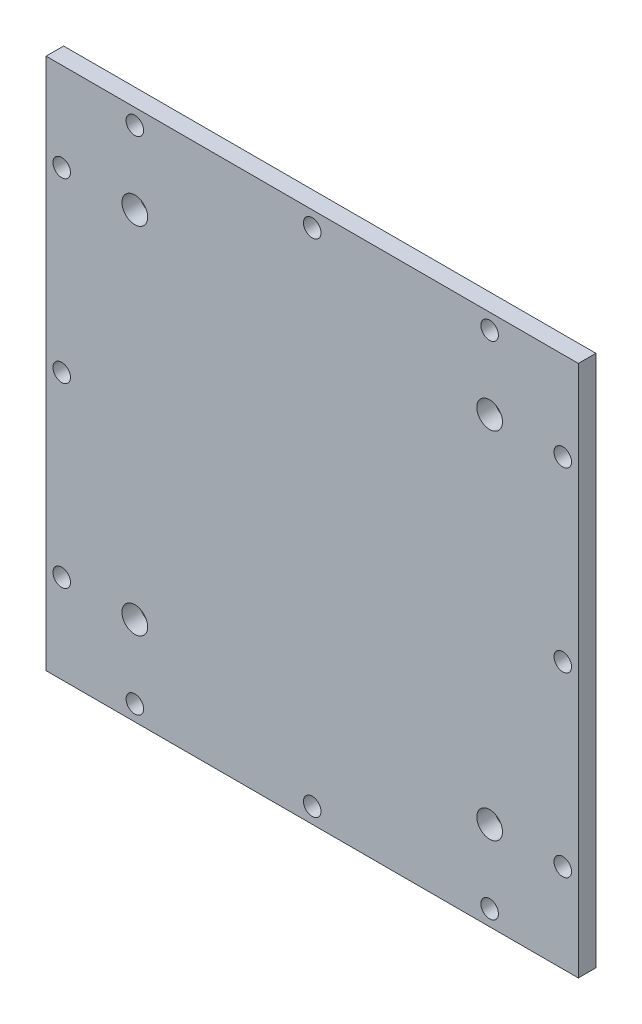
ISO-10303-21;
HEADER;
FILE_DESCRIPTION(('STEP AP214'),'2;1');
FILE_NAME('part.step','',(''),(''),'','','');
FILE_SCHEMA(('AUTOMOTIVE_DESIGN { 1 0 10303 214 1 1 1 1 }'));
ENDSEC;
DATA;
#1=APPLICATION_CONTEXT('core data for automotive mechanical design processes');
#2=APPLICATION_PROTOCOL_DEFINITION('international standard','automotive_design',2000,#1);
#3=PRODUCT_CONTEXT('',#1,'mechanical');
#4=PRODUCT('Part','Part','',(#3));
#5=PRODUCT_RELATED_PRODUCT_CATEGORY('part','',(#4));
#6=PRODUCT_DEFINITION_FORMATION('','',#4);
#7=PRODUCT_DEFINITION_CONTEXT('part definition',#1,'design');
#8=PRODUCT_DEFINITION('design','',#6,#7);
#9=PRODUCT_DEFINITION_SHAPE('','',#8);
#10=(LENGTH_UNIT() NAMED_UNIT(*) SI_UNIT(.MILLI.,.METRE.));
#11=(NAMED_UNIT(*) PLANE_ANGLE_UNIT() SI_UNIT($,.RADIAN.));
#12=(NAMED_UNIT(*) SI_UNIT($,.STERADIAN.) SOLID_ANGLE_UNIT());
#13=UNCERTAINTY_MEASURE_WITH_UNIT(LENGTH_MEASURE(1.E-05),#10,'distance_accuracy_value','');
#14=(GEOMETRIC_REPRESENTATION_CONTEXT(3) GLOBAL_UNCERTAINTY_ASSIGNED_CONTEXT((#13)) GLOBAL_UNIT_ASSIGNED_CONTEXT((#10,
#11,#12)) REPRESENTATION_CONTEXT('',''));
#15=CARTESIAN_POINT('',(0.,0.,0.));
#16=DIRECTION('',(0.,0.,1.));
#17=DIRECTION('',(1.,0.,0.));
#18=AXIS2_PLACEMENT_3D('',#15,#16,#17);
#19=CARTESIAN_POINT('',(-68.25,68.25,4.5));
#20=DIRECTION('',(1.,0.,0.));
#21=DIRECTION('',(0.,0.,-1.));
#22=AXIS2_PLACEMENT_3D('',#19,#20,#21);
#23=PLANE('',#22);
#24=DIRECTION('',(0.,-1.,0.));
#25=VECTOR('',#24,1.);
#26=CARTESIAN_POINT('',(-68.25,68.25,0.));
#27=LINE('',#26,#25);
#28=CARTESIAN_POINT('',(-68.25,68.25,0.));
#29=VERTEX_POINT('',#28);
#30=CARTESIAN_POINT('',(-68.25,-68.25,0.));
#31=VERTEX_POINT('',#30);
#32=EDGE_CURVE('E96',#29,#31,#27,.T.);
#33=ORIENTED_EDGE('',*,*,#32,.T.);
#34=DIRECTION('',(0.,0.,-1.));
#35=VECTOR('',#34,1.);
#36=CARTESIAN_POINT('',(-68.25,-68.25,4.5));
#37=LINE('',#36,#35);
#38=CARTESIAN_POINT('',(-68.25,-68.25,4.5));
#39=VERTEX_POINT('',#38);
#40=EDGE_CURVE('E11',#39,#31,#37,.T.);
#41=ORIENTED_EDGE('',*,*,#40,.F.);
#42=DIRECTION('',(0.,-1.,0.));
#43=VECTOR('',#42,1.);
#44=CARTESIAN_POINT('',(-68.25,68.25,4.5));
#45=LINE('',#44,#43);
#46=CARTESIAN_POINT('',(-68.25,68.25,4.5));
#47=VERTEX_POINT('',#46);
#48=EDGE_CURVE('E84',#47,#39,#45,.T.);
#49=ORIENTED_EDGE('',*,*,#48,.F.);
#50=DIRECTION('',(0.,0.,-1.));
#51=VECTOR('',#50,1.);
#52=CARTESIAN_POINT('',(-68.25,68.25,4.5));
#53=LINE('',#52,#51);
#54=EDGE_CURVE('E92',#47,#29,#53,.T.);
#55=ORIENTED_EDGE('',*,*,#54,.T.);
#56=EDGE_LOOP('',(#33,#41,#49,#55));
#57=FACE_BOUND('',#56,.T.);
#58=ADVANCED_FACE('F33',(#57),#23,.F.);
#59=CARTESIAN_POINT('',(-68.25,-68.25,4.5));
#60=DIRECTION('',(0.,1.,0.));
#61=DIRECTION('',(0.,0.,1.));
#62=AXIS2_PLACEMENT_3D('',#59,#60,#61);
#63=PLANE('',#62);
#64=DIRECTION('',(1.,0.,0.));
#65=VECTOR('',#64,1.);
#66=CARTESIAN_POINT('',(-68.25,-68.25,0.));
#67=LINE('',#66,#65);
#68=CARTESIAN_POINT('',(68.25,-68.25,0.));
#69=VERTEX_POINT('',#68);
#70=EDGE_CURVE('E88',#31,#69,#67,.T.);
#71=ORIENTED_EDGE('',*,*,#70,.T.);
#72=DIRECTION('',(0.,0.,-1.));
#73=VECTOR('',#72,1.);
#74=CARTESIAN_POINT('',(68.25,-68.25,4.5));
#75=LINE('',#74,#73);
#76=CARTESIAN_POINT('',(68.25,-68.25,4.5));
#77=VERTEX_POINT('',#76);
#78=EDGE_CURVE('E41',#77,#69,#75,.T.);
#79=ORIENTED_EDGE('',*,*,#78,.F.);
#80=DIRECTION('',(1.,0.,0.));
#81=VECTOR('',#80,1.);
#82=CARTESIAN_POINT('',(-68.25,-68.25,4.5));
#83=LINE('',#82,#81);
#84=EDGE_CURVE('E79',#39,#77,#83,.T.);
#85=ORIENTED_EDGE('',*,*,#84,.F.);
#86=ORIENTED_EDGE('',*,*,#40,.T.);
#87=EDGE_LOOP('',(#71,#79,#85,#86));
#88=FACE_BOUND('',#87,.T.);
#89=ADVANCED_FACE('F87',(#88),#63,.F.);
#90=CARTESIAN_POINT('',(68.25,68.25,4.5));
#91=DIRECTION('',(-1.,0.,0.));
#92=DIRECTION('',(0.,0.,1.));
#93=AXIS2_PLACEMENT_3D('',#90,#91,#92);
#94=PLANE('',#93);
#95=DIRECTION('',(0.,1.,0.));
#96=VECTOR('',#95,1.);
#97=CARTESIAN_POINT('',(68.25,68.25,0.));
#98=LINE('',#97,#96);
#99=CARTESIAN_POINT('',(68.25,68.25,0.));
#100=VERTEX_POINT('',#99);
#101=EDGE_CURVE('E66',#69,#100,#98,.T.);
#102=ORIENTED_EDGE('',*,*,#101,.T.);
#103=DIRECTION('',(0.,0.,-1.));
#104=VECTOR('',#103,1.);
#105=CARTESIAN_POINT('',(68.25,68.25,4.5));
#106=LINE('',#105,#104);
#107=CARTESIAN_POINT('',(68.25,68.25,4.5));
#108=VERTEX_POINT('',#107);
#109=EDGE_CURVE('E89',#108,#100,#106,.T.);
#110=ORIENTED_EDGE('',*,*,#109,.F.);
#111=DIRECTION('',(0.,1.,0.));
#112=VECTOR('',#111,1.);
#113=CARTESIAN_POINT('',(68.25,68.25,4.5));
#114=LINE('',#113,#112);
#115=EDGE_CURVE('E82',#77,#108,#114,.T.);
#116=ORIENTED_EDGE('',*,*,#115,.F.);
#117=ORIENTED_EDGE('',*,*,#78,.T.);
#118=EDGE_LOOP('',(#102,#110,#116,#117));
#119=FACE_BOUND('',#118,.T.);
#120=ADVANCED_FACE('F90',(#119),#94,.F.);
#121=CARTESIAN_POINT('',(-68.25,68.25,4.5));
#122=DIRECTION('',(0.,-1.,0.));
#123=DIRECTION('',(0.,0.,-1.));
#124=AXIS2_PLACEMENT_3D('',#121,#122,#123);
#125=PLANE('',#124);
#126=DIRECTION('',(-1.,0.,0.));
#127=VECTOR('',#126,1.);
#128=CARTESIAN_POINT('',(-68.25,68.25,0.));
#129=LINE('',#128,#127);
#130=EDGE_CURVE('E72',#100,#29,#129,.T.);
#131=ORIENTED_EDGE('',*,*,#130,.T.);
#132=ORIENTED_EDGE('',*,*,#54,.F.);
#133=DIRECTION('',(-1.,0.,0.));
#134=VECTOR('',#133,1.);
#135=CARTESIAN_POINT('',(-68.25,68.25,4.5));
#136=LINE('',#135,#134);
#137=EDGE_CURVE('E49',#108,#47,#136,.T.);
#138=ORIENTED_EDGE('',*,*,#137,.F.);
#139=ORIENTED_EDGE('',*,*,#109,.T.);
#140=EDGE_LOOP('',(#131,#132,#138,#139));
#141=FACE_BOUND('',#140,.T.);
#142=ADVANCED_FACE('F104',(#141),#125,.F.);
#143=CARTESIAN_POINT('',(0.,0.,4.5));
#144=DIRECTION('',(0.,0.,1.));
#145=DIRECTION('',(1.,0.,0.));
#146=AXIS2_PLACEMENT_3D('',#143,#144,#145);
#147=PLANE('',#146);
#148=CARTESIAN_POINT('',(-45.5,45.5,4.5));
#149=DIRECTION('',(0.,0.,1.));
#150=DIRECTION('',(1.,0.,0.));
#151=AXIS2_PLACEMENT_3D('',#148,#149,#150);
#152=CIRCLE('',#151,3.3);
#153=CARTESIAN_POINT('',(-42.2,45.5,4.5));
#154=VERTEX_POINT('',#153);
#155=EDGE_CURVE('E202',#154,#154,#152,.T.);
#156=ORIENTED_EDGE('',*,*,#155,.F.);
#157=EDGE_LOOP('',(#156));
#158=FACE_BOUND('',#157,.T.);
#159=CARTESIAN_POINT('',(-45.5,-45.5,4.5));
#160=DIRECTION('',(0.,0.,1.));
#161=DIRECTION('',(1.,0.,0.));
#162=AXIS2_PLACEMENT_3D('',#159,#160,#161);
#163=CIRCLE('',#162,3.3);
#164=CARTESIAN_POINT('',(-42.2,-45.5,4.5));
#165=VERTEX_POINT('',#164);
#166=EDGE_CURVE('E196',#165,#165,#163,.T.);
#167=ORIENTED_EDGE('',*,*,#166,.F.);
#168=EDGE_LOOP('',(#167));
#169=FACE_BOUND('',#168,.T.);
#170=CARTESIAN_POINT('',(45.5,-45.5,4.5));
#171=DIRECTION('',(0.,0.,1.));
#172=DIRECTION('',(1.,0.,0.));
#173=AXIS2_PLACEMENT_3D('',#170,#171,#172);
#174=CIRCLE('',#173,3.3);
#175=CARTESIAN_POINT('',(48.8,-45.5,4.5));
#176=VERTEX_POINT('',#175);
#177=EDGE_CURVE('E190',#176,#176,#174,.T.);
#178=ORIENTED_EDGE('',*,*,#177,.F.);
#179=EDGE_LOOP('',(#178));
#180=FACE_BOUND('',#179,.T.);
#181=CARTESIAN_POINT('',(45.5,45.5,4.5));
#182=DIRECTION('',(0.,0.,1.));
#183=DIRECTION('',(1.,0.,0.));
#184=AXIS2_PLACEMENT_3D('',#181,#182,#183);
#185=CIRCLE('',#184,3.3);
#186=CARTESIAN_POINT('',(48.8,45.5,4.5));
#187=VERTEX_POINT('',#186);
#188=EDGE_CURVE('E184',#187,#187,#185,.T.);
#189=ORIENTED_EDGE('',*,*,#188,.F.);
#190=EDGE_LOOP('',(#189));
#191=FACE_BOUND('',#190,.T.);
#192=CARTESIAN_POINT('',(-64.25,45.5,4.5));
#193=DIRECTION('',(0.,0.,1.));
#194=DIRECTION('',(1.,0.,0.));
#195=AXIS2_PLACEMENT_3D('',#192,#193,#194);
#196=CIRCLE('',#195,2.25);
#197=CARTESIAN_POINT('',(-62.,45.5,4.5));
#198=VERTEX_POINT('',#197);
#199=EDGE_CURVE('E178',#198,#198,#196,.T.);
#200=ORIENTED_EDGE('',*,*,#199,.F.);
#201=EDGE_LOOP('',(#200));
#202=FACE_BOUND('',#201,.T.);
#203=CARTESIAN_POINT('',(-64.25,0.,4.5));
#204=DIRECTION('',(0.,0.,1.));
#205=DIRECTION('',(1.,0.,0.));
#206=AXIS2_PLACEMENT_3D('',#203,#204,#205);
#207=CIRCLE('',#206,2.25);
#208=CARTESIAN_POINT('',(-62.,0.,4.5));
#209=VERTEX_POINT('',#208);
#210=EDGE_CURVE('E172',#209,#209,#207,.T.);
#211=ORIENTED_EDGE('',*,*,#210,.F.);
#212=EDGE_LOOP('',(#211));
#213=FACE_BOUND('',#212,.T.);
#214=CARTESIAN_POINT('',(-64.25,-45.5,4.5));
#215=DIRECTION('',(0.,0.,1.));
#216=DIRECTION('',(1.,0.,0.));
#217=AXIS2_PLACEMENT_3D('',#214,#215,#216);
#218=CIRCLE('',#217,2.25);
#219=CARTESIAN_POINT('',(-62.,-45.5,4.5));
#220=VERTEX_POINT('',#219);
#221=EDGE_CURVE('E166',#220,#220,#218,.T.);
#222=ORIENTED_EDGE('',*,*,#221,.F.);
#223=EDGE_LOOP('',(#222));
#224=FACE_BOUND('',#223,.T.);
#225=CARTESIAN_POINT('',(-45.5,64.25,4.5));
#226=DIRECTION('',(0.,0.,1.));
#227=DIRECTION('',(1.,0.,0.));
#228=AXIS2_PLACEMENT_3D('',#225,#226,#227);
#229=CIRCLE('',#228,2.25);
#230=CARTESIAN_POINT('',(-43.25,64.25,4.5));
#231=VERTEX_POINT('',#230);
#232=EDGE_CURVE('E160',#231,#231,#229,.T.);
#233=ORIENTED_EDGE('',*,*,#232,.F.);
#234=EDGE_LOOP('',(#233));
#235=FACE_BOUND('',#234,.T.);
#236=CARTESIAN_POINT('',(0.,64.25,4.5));
#237=DIRECTION('',(0.,0.,1.));
#238=DIRECTION('',(1.,0.,0.));
#239=AXIS2_PLACEMENT_3D('',#236,#237,#238);
#240=CIRCLE('',#239,2.25);
#241=CARTESIAN_POINT('',(2.25,64.25,4.5));
#242=VERTEX_POINT('',#241);
#243=EDGE_CURVE('E154',#242,#242,#240,.T.);
#244=ORIENTED_EDGE('',*,*,#243,.F.);
#245=EDGE_LOOP('',(#244));
#246=FACE_BOUND('',#245,.T.);
#247=CARTESIAN_POINT('',(45.5,64.25,4.5));
#248=DIRECTION('',(0.,0.,1.));
#249=DIRECTION('',(1.,0.,0.));
#250=AXIS2_PLACEMENT_3D('',#247,#248,#249);
#251=CIRCLE('',#250,2.25);
#252=CARTESIAN_POINT('',(47.75,64.25,4.5));
#253=VERTEX_POINT('',#252);
#254=EDGE_CURVE('E148',#253,#253,#251,.T.);
#255=ORIENTED_EDGE('',*,*,#254,.F.);
#256=EDGE_LOOP('',(#255));
#257=FACE_BOUND('',#256,.T.);
#258=CARTESIAN_POINT('',(64.25,-45.5,4.5));
#259=DIRECTION('',(0.,0.,1.));
#260=DIRECTION('',(1.,0.,0.));
#261=AXIS2_PLACEMENT_3D('',#258,#259,#260);
#262=CIRCLE('',#261,2.25);
#263=CARTESIAN_POINT('',(66.5,-45.5,4.5));
#264=VERTEX_POINT('',#263);
#265=EDGE_CURVE('E142',#264,#264,#262,.T.);
#266=ORIENTED_EDGE('',*,*,#265,.F.);
#267=EDGE_LOOP('',(#266));
#268=FACE_BOUND('',#267,.T.);
#269=CARTESIAN_POINT('',(64.25,0.,4.5));
#270=DIRECTION('',(0.,0.,1.));
#271=DIRECTION('',(1.,0.,0.));
#272=AXIS2_PLACEMENT_3D('',#269,#270,#271);
#273=CIRCLE('',#272,2.25);
#274=CARTESIAN_POINT('',(66.5,0.,4.5));
#275=VERTEX_POINT('',#274);
#276=EDGE_CURVE('E136',#275,#275,#273,.T.);
#277=ORIENTED_EDGE('',*,*,#276,.F.);
#278=EDGE_LOOP('',(#277));
#279=FACE_BOUND('',#278,.T.);
#280=CARTESIAN_POINT('',(64.25,45.5,4.5));
#281=DIRECTION('',(0.,0.,1.));
#282=DIRECTION('',(1.,0.,0.));
#283=AXIS2_PLACEMENT_3D('',#280,#281,#282);
#284=CIRCLE('',#283,2.25);
#285=CARTESIAN_POINT('',(66.5,45.5,4.5));
#286=VERTEX_POINT('',#285);
#287=EDGE_CURVE('E130',#286,#286,#284,.T.);
#288=ORIENTED_EDGE('',*,*,#287,.F.);
#289=EDGE_LOOP('',(#288));
#290=FACE_BOUND('',#289,.T.);
#291=CARTESIAN_POINT('',(45.5,-64.25,4.5));
#292=DIRECTION('',(0.,0.,1.));
#293=DIRECTION('',(1.,0.,0.));
#294=AXIS2_PLACEMENT_3D('',#291,#292,#293);
#295=CIRCLE('',#294,2.25);
#296=CARTESIAN_POINT('',(47.75,-64.25,4.5));
#297=VERTEX_POINT('',#296);
#298=EDGE_CURVE('E124',#297,#297,#295,.T.);
#299=ORIENTED_EDGE('',*,*,#298,.F.);
#300=EDGE_LOOP('',(#299));
#301=FACE_BOUND('',#300,.T.);
#302=CARTESIAN_POINT('',(0.,-64.25,4.5));
#303=DIRECTION('',(0.,0.,1.));
#304=DIRECTION('',(1.,0.,0.));
#305=AXIS2_PLACEMENT_3D('',#302,#303,#304);
#306=CIRCLE('',#305,2.25);
#307=CARTESIAN_POINT('',(2.25,-64.25,4.5));
#308=VERTEX_POINT('',#307);
#309=EDGE_CURVE('E118',#308,#308,#306,.T.);
#310=ORIENTED_EDGE('',*,*,#309,.F.);
#311=EDGE_LOOP('',(#310));
#312=FACE_BOUND('',#311,.T.);
#313=CARTESIAN_POINT('',(-45.5,-64.25,4.5));
#314=DIRECTION('',(0.,0.,1.));
#315=DIRECTION('',(1.,0.,0.));
#316=AXIS2_PLACEMENT_3D('',#313,#314,#315);
#317=CIRCLE('',#316,2.25);
#318=CARTESIAN_POINT('',(-43.25,-64.25,4.5));
#319=VERTEX_POINT('',#318);
#320=EDGE_CURVE('E112',#319,#319,#317,.T.);
#321=ORIENTED_EDGE('',*,*,#320,.F.);
#322=EDGE_LOOP('',(#321));
#323=FACE_BOUND('',#322,.T.);
#324=ORIENTED_EDGE('',*,*,#48,.T.);
#325=ORIENTED_EDGE('',*,*,#84,.T.);
#326=ORIENTED_EDGE('',*,*,#115,.T.);
#327=ORIENTED_EDGE('',*,*,#137,.T.);
#328=EDGE_LOOP('',(#324,#325,#326,#327));
#329=FACE_BOUND('',#328,.T.);
#330=ADVANCED_FACE('F80',(#158,#169,#180,#191,#202,#213,#224,#235,#246,#257,#268,#279,#290,#301,
#312,#323,#329),#147,.T.);
#331=CARTESIAN_POINT('',(0.,0.,0.));
#332=DIRECTION('',(0.,0.,1.));
#333=DIRECTION('',(1.,0.,0.));
#334=AXIS2_PLACEMENT_3D('',#331,#332,#333);
#335=PLANE('',#334);
#336=CARTESIAN_POINT('',(-45.5,45.5,0.));
#337=DIRECTION('',(0.,0.,1.));
#338=DIRECTION('',(1.,0.,0.));
#339=AXIS2_PLACEMENT_3D('',#336,#337,#338);
#340=CIRCLE('',#339,3.3);
#341=CARTESIAN_POINT('',(-42.2,45.5,0.));
#342=VERTEX_POINT('',#341);
#343=EDGE_CURVE('E199',#342,#342,#340,.T.);
#344=ORIENTED_EDGE('',*,*,#343,.T.);
#345=EDGE_LOOP('',(#344));
#346=FACE_BOUND('',#345,.T.);
#347=CARTESIAN_POINT('',(-45.5,-45.5,0.));
#348=DIRECTION('',(0.,0.,1.));
#349=DIRECTION('',(1.,0.,0.));
#350=AXIS2_PLACEMENT_3D('',#347,#348,#349);
#351=CIRCLE('',#350,3.3);
#352=CARTESIAN_POINT('',(-42.2,-45.5,0.));
#353=VERTEX_POINT('',#352);
#354=EDGE_CURVE('E193',#353,#353,#351,.T.);
#355=ORIENTED_EDGE('',*,*,#354,.T.);
#356=EDGE_LOOP('',(#355));
#357=FACE_BOUND('',#356,.T.);
#358=CARTESIAN_POINT('',(45.5,-45.5,0.));
#359=DIRECTION('',(0.,0.,1.));
#360=DIRECTION('',(1.,0.,0.));
#361=AXIS2_PLACEMENT_3D('',#358,#359,#360);
#362=CIRCLE('',#361,3.3);
#363=CARTESIAN_POINT('',(48.8,-45.5,0.));
#364=VERTEX_POINT('',#363);
#365=EDGE_CURVE('E187',#364,#364,#362,.T.);
#366=ORIENTED_EDGE('',*,*,#365,.T.);
#367=EDGE_LOOP('',(#366));
#368=FACE_BOUND('',#367,.T.);
#369=CARTESIAN_POINT('',(45.5,45.5,0.));
#370=DIRECTION('',(0.,0.,1.));
#371=DIRECTION('',(1.,0.,0.));
#372=AXIS2_PLACEMENT_3D('',#369,#370,#371);
#373=CIRCLE('',#372,3.3);
#374=CARTESIAN_POINT('',(48.8,45.5,0.));
#375=VERTEX_POINT('',#374);
#376=EDGE_CURVE('E181',#375,#375,#373,.T.);
#377=ORIENTED_EDGE('',*,*,#376,.T.);
#378=EDGE_LOOP('',(#377));
#379=FACE_BOUND('',#378,.T.);
#380=CARTESIAN_POINT('',(-64.25,45.5,0.));
#381=DIRECTION('',(0.,0.,1.));
#382=DIRECTION('',(1.,0.,0.));
#383=AXIS2_PLACEMENT_3D('',#380,#381,#382);
#384=CIRCLE('',#383,2.25);
#385=CARTESIAN_POINT('',(-62.,45.5,0.));
#386=VERTEX_POINT('',#385);
#387=EDGE_CURVE('E175',#386,#386,#384,.T.);
#388=ORIENTED_EDGE('',*,*,#387,.T.);
#389=EDGE_LOOP('',(#388));
#390=FACE_BOUND('',#389,.T.);
#391=CARTESIAN_POINT('',(-64.25,0.,0.));
#392=DIRECTION('',(0.,0.,1.));
#393=DIRECTION('',(1.,0.,0.));
#394=AXIS2_PLACEMENT_3D('',#391,#392,#393);
#395=CIRCLE('',#394,2.25);
#396=CARTESIAN_POINT('',(-62.,0.,0.));
#397=VERTEX_POINT('',#396);
#398=EDGE_CURVE('E169',#397,#397,#395,.T.);
#399=ORIENTED_EDGE('',*,*,#398,.T.);
#400=EDGE_LOOP('',(#399));
#401=FACE_BOUND('',#400,.T.);
#402=CARTESIAN_POINT('',(-64.25,-45.5,0.));
#403=DIRECTION('',(0.,0.,1.));
#404=DIRECTION('',(1.,0.,0.));
#405=AXIS2_PLACEMENT_3D('',#402,#403,#404);
#406=CIRCLE('',#405,2.25);
#407=CARTESIAN_POINT('',(-62.,-45.5,0.));
#408=VERTEX_POINT('',#407);
#409=EDGE_CURVE('E163',#408,#408,#406,.T.);
#410=ORIENTED_EDGE('',*,*,#409,.T.);
#411=EDGE_LOOP('',(#410));
#412=FACE_BOUND('',#411,.T.);
#413=CARTESIAN_POINT('',(-45.5,64.25,0.));
#414=DIRECTION('',(0.,0.,1.));
#415=DIRECTION('',(1.,0.,0.));
#416=AXIS2_PLACEMENT_3D('',#413,#414,#415);
#417=CIRCLE('',#416,2.25);
#418=CARTESIAN_POINT('',(-43.25,64.25,0.));
#419=VERTEX_POINT('',#418);
#420=EDGE_CURVE('E157',#419,#419,#417,.T.);
#421=ORIENTED_EDGE('',*,*,#420,.T.);
#422=EDGE_LOOP('',(#421));
#423=FACE_BOUND('',#422,.T.);
#424=CARTESIAN_POINT('',(0.,64.25,0.));
#425=DIRECTION('',(0.,0.,1.));
#426=DIRECTION('',(1.,0.,0.));
#427=AXIS2_PLACEMENT_3D('',#424,#425,#426);
#428=CIRCLE('',#427,2.25);
#429=CARTESIAN_POINT('',(2.25,64.25,0.));
#430=VERTEX_POINT('',#429);
#431=EDGE_CURVE('E151',#430,#430,#428,.T.);
#432=ORIENTED_EDGE('',*,*,#431,.T.);
#433=EDGE_LOOP('',(#432));
#434=FACE_BOUND('',#433,.T.);
#435=CARTESIAN_POINT('',(45.5,64.25,0.));
#436=DIRECTION('',(0.,0.,1.));
#437=DIRECTION('',(1.,0.,0.));
#438=AXIS2_PLACEMENT_3D('',#435,#436,#437);
#439=CIRCLE('',#438,2.25);
#440=CARTESIAN_POINT('',(47.75,64.25,0.));
#441=VERTEX_POINT('',#440);
#442=EDGE_CURVE('E145',#441,#441,#439,.T.);
#443=ORIENTED_EDGE('',*,*,#442,.T.);
#444=EDGE_LOOP('',(#443));
#445=FACE_BOUND('',#444,.T.);
#446=CARTESIAN_POINT('',(64.25,-45.5,0.));
#447=DIRECTION('',(0.,0.,1.));
#448=DIRECTION('',(1.,0.,0.));
#449=AXIS2_PLACEMENT_3D('',#446,#447,#448);
#450=CIRCLE('',#449,2.25);
#451=CARTESIAN_POINT('',(66.5,-45.5,0.));
#452=VERTEX_POINT('',#451);
#453=EDGE_CURVE('E139',#452,#452,#450,.T.);
#454=ORIENTED_EDGE('',*,*,#453,.T.);
#455=EDGE_LOOP('',(#454));
#456=FACE_BOUND('',#455,.T.);
#457=CARTESIAN_POINT('',(64.25,0.,0.));
#458=DIRECTION('',(0.,0.,1.));
#459=DIRECTION('',(1.,0.,0.));
#460=AXIS2_PLACEMENT_3D('',#457,#458,#459);
#461=CIRCLE('',#460,2.25);
#462=CARTESIAN_POINT('',(66.5,0.,0.));
#463=VERTEX_POINT('',#462);
#464=EDGE_CURVE('E133',#463,#463,#461,.T.);
#465=ORIENTED_EDGE('',*,*,#464,.T.);
#466=EDGE_LOOP('',(#465));
#467=FACE_BOUND('',#466,.T.);
#468=CARTESIAN_POINT('',(64.25,45.5,0.));
#469=DIRECTION('',(0.,0.,1.));
#470=DIRECTION('',(1.,0.,0.));
#471=AXIS2_PLACEMENT_3D('',#468,#469,#470);
#472=CIRCLE('',#471,2.25);
#473=CARTESIAN_POINT('',(66.5,45.5,0.));
#474=VERTEX_POINT('',#473);
#475=EDGE_CURVE('E127',#474,#474,#472,.T.);
#476=ORIENTED_EDGE('',*,*,#475,.T.);
#477=EDGE_LOOP('',(#476));
#478=FACE_BOUND('',#477,.T.);
#479=CARTESIAN_POINT('',(45.5,-64.25,0.));
#480=DIRECTION('',(0.,0.,1.));
#481=DIRECTION('',(1.,0.,0.));
#482=AXIS2_PLACEMENT_3D('',#479,#480,#481);
#483=CIRCLE('',#482,2.25);
#484=CARTESIAN_POINT('',(47.75,-64.25,0.));
#485=VERTEX_POINT('',#484);
#486=EDGE_CURVE('E121',#485,#485,#483,.T.);
#487=ORIENTED_EDGE('',*,*,#486,.T.);
#488=EDGE_LOOP('',(#487));
#489=FACE_BOUND('',#488,.T.);
#490=CARTESIAN_POINT('',(0.,-64.25,0.));
#491=DIRECTION('',(0.,0.,1.));
#492=DIRECTION('',(1.,0.,0.));
#493=AXIS2_PLACEMENT_3D('',#490,#491,#492);
#494=CIRCLE('',#493,2.25);
#495=CARTESIAN_POINT('',(2.25,-64.25,0.));
#496=VERTEX_POINT('',#495);
#497=EDGE_CURVE('E115',#496,#496,#494,.T.);
#498=ORIENTED_EDGE('',*,*,#497,.T.);
#499=EDGE_LOOP('',(#498));
#500=FACE_BOUND('',#499,.T.);
#501=CARTESIAN_POINT('',(-45.5,-64.25,0.));
#502=DIRECTION('',(0.,0.,1.));
#503=DIRECTION('',(1.,0.,0.));
#504=AXIS2_PLACEMENT_3D('',#501,#502,#503);
#505=CIRCLE('',#504,2.25);
#506=CARTESIAN_POINT('',(-43.25,-64.25,0.));
#507=VERTEX_POINT('',#506);
#508=EDGE_CURVE('E99',#507,#507,#505,.T.);
#509=ORIENTED_EDGE('',*,*,#508,.T.);
#510=EDGE_LOOP('',(#509));
#511=FACE_BOUND('',#510,.T.);
#512=ORIENTED_EDGE('',*,*,#32,.F.);
#513=ORIENTED_EDGE('',*,*,#130,.F.);
#514=ORIENTED_EDGE('',*,*,#101,.F.);
#515=ORIENTED_EDGE('',*,*,#70,.F.);
#516=EDGE_LOOP('',(#512,#513,#514,#515));
#517=FACE_BOUND('',#516,.T.);
#518=ADVANCED_FACE('F107',(#346,#357,#368,#379,#390,#401,#412,#423,#434,#445,#456,#467,#478,
#489,#500,#511,#517),#335,.F.);
#519=CARTESIAN_POINT('',(-45.5,-64.25,4.5));
#520=DIRECTION('',(0.,0.,1.));
#521=DIRECTION('',(1.,0.,0.));
#522=AXIS2_PLACEMENT_3D('',#519,#520,#521);
#523=CYLINDRICAL_SURFACE('',#522,2.25);
#524=ORIENTED_EDGE('',*,*,#508,.F.);
#525=EDGE_LOOP('',(#524));
#526=FACE_BOUND('',#525,.T.);
#527=ORIENTED_EDGE('',*,*,#320,.T.);
#528=EDGE_LOOP('',(#527));
#529=FACE_BOUND('',#528,.T.);
#530=ADVANCED_FACE('F241',(#526,#529),#523,.F.);
#531=CARTESIAN_POINT('',(0.,-64.25,4.5));
#532=DIRECTION('',(0.,0.,1.));
#533=DIRECTION('',(1.,0.,0.));
#534=AXIS2_PLACEMENT_3D('',#531,#532,#533);
#535=CYLINDRICAL_SURFACE('',#534,2.25);
#536=ORIENTED_EDGE('',*,*,#497,.F.);
#537=EDGE_LOOP('',(#536));
#538=FACE_BOUND('',#537,.T.);
#539=ORIENTED_EDGE('',*,*,#309,.T.);
#540=EDGE_LOOP('',(#539));
#541=FACE_BOUND('',#540,.T.);
#542=ADVANCED_FACE('F243',(#538,#541),#535,.F.);
#543=CARTESIAN_POINT('',(45.5,-64.25,4.5));
#544=DIRECTION('',(0.,0.,1.));
#545=DIRECTION('',(1.,0.,0.));
#546=AXIS2_PLACEMENT_3D('',#543,#544,#545);
#547=CYLINDRICAL_SURFACE('',#546,2.25);
#548=ORIENTED_EDGE('',*,*,#486,.F.);
#549=EDGE_LOOP('',(#548));
#550=FACE_BOUND('',#549,.T.);
#551=ORIENTED_EDGE('',*,*,#298,.T.);
#552=EDGE_LOOP('',(#551));
#553=FACE_BOUND('',#552,.T.);
#554=ADVANCED_FACE('F250',(#550,#553),#547,.F.);
#555=CARTESIAN_POINT('',(64.25,45.5,4.5));
#556=DIRECTION('',(0.,0.,1.));
#557=DIRECTION('',(1.,0.,0.));
#558=AXIS2_PLACEMENT_3D('',#555,#556,#557);
#559=CYLINDRICAL_SURFACE('',#558,2.25);
#560=ORIENTED_EDGE('',*,*,#475,.F.);
#561=EDGE_LOOP('',(#560));
#562=FACE_BOUND('',#561,.T.);
#563=ORIENTED_EDGE('',*,*,#287,.T.);
#564=EDGE_LOOP('',(#563));
#565=FACE_BOUND('',#564,.T.);
#566=ADVANCED_FACE('F357',(#562,#565),#559,.F.);
#567=CARTESIAN_POINT('',(64.25,0.,4.5));
#568=DIRECTION('',(0.,0.,1.));
#569=DIRECTION('',(1.,0.,0.));
#570=AXIS2_PLACEMENT_3D('',#567,#568,#569);
#571=CYLINDRICAL_SURFACE('',#570,2.25);
#572=ORIENTED_EDGE('',*,*,#464,.F.);
#573=EDGE_LOOP('',(#572));
#574=FACE_BOUND('',#573,.T.);
#575=ORIENTED_EDGE('',*,*,#276,.T.);
#576=EDGE_LOOP('',(#575));
#577=FACE_BOUND('',#576,.T.);
#578=ADVANCED_FACE('F353',(#574,#577),#571,.F.);
#579=CARTESIAN_POINT('',(64.25,-45.5,4.5));
#580=DIRECTION('',(0.,0.,1.));
#581=DIRECTION('',(1.,0.,0.));
#582=AXIS2_PLACEMENT_3D('',#579,#580,#581);
#583=CYLINDRICAL_SURFACE('',#582,2.25);
#584=ORIENTED_EDGE('',*,*,#453,.F.);
#585=EDGE_LOOP('',(#584));
#586=FACE_BOUND('',#585,.T.);
#587=ORIENTED_EDGE('',*,*,#265,.T.);
#588=EDGE_LOOP('',(#587));
#589=FACE_BOUND('',#588,.T.);
#590=ADVANCED_FACE('F349',(#586,#589),#583,.F.);
#591=CARTESIAN_POINT('',(45.5,64.25,4.5));
#592=DIRECTION('',(0.,0.,1.));
#593=DIRECTION('',(1.,0.,0.));
#594=AXIS2_PLACEMENT_3D('',#591,#592,#593);
#595=CYLINDRICAL_SURFACE('',#594,2.25);
#596=ORIENTED_EDGE('',*,*,#442,.F.);
#597=EDGE_LOOP('',(#596));
#598=FACE_BOUND('',#597,.T.);
#599=ORIENTED_EDGE('',*,*,#254,.T.);
#600=EDGE_LOOP('',(#599));
#601=FACE_BOUND('',#600,.T.);
#602=ADVANCED_FACE('F345',(#598,#601),#595,.F.);
#603=CARTESIAN_POINT('',(0.,64.25,4.5));
#604=DIRECTION('',(0.,0.,1.));
#605=DIRECTION('',(1.,0.,0.));
#606=AXIS2_PLACEMENT_3D('',#603,#604,#605);
#607=CYLINDRICAL_SURFACE('',#606,2.25);
#608=ORIENTED_EDGE('',*,*,#431,.F.);
#609=EDGE_LOOP('',(#608));
#610=FACE_BOUND('',#609,.T.);
#611=ORIENTED_EDGE('',*,*,#243,.T.);
#612=EDGE_LOOP('',(#611));
#613=FACE_BOUND('',#612,.T.);
#614=ADVANCED_FACE('F341',(#610,#613),#607,.F.);
#615=CARTESIAN_POINT('',(-45.5,64.25,4.5));
#616=DIRECTION('',(0.,0.,1.));
#617=DIRECTION('',(1.,0.,0.));
#618=AXIS2_PLACEMENT_3D('',#615,#616,#617);
#619=CYLINDRICAL_SURFACE('',#618,2.25);
#620=ORIENTED_EDGE('',*,*,#420,.F.);
#621=EDGE_LOOP('',(#620));
#622=FACE_BOUND('',#621,.T.);
#623=ORIENTED_EDGE('',*,*,#232,.T.);
#624=EDGE_LOOP('',(#623));
#625=FACE_BOUND('',#624,.T.);
#626=ADVANCED_FACE('F337',(#622,#625),#619,.F.);
#627=CARTESIAN_POINT('',(-64.25,-45.5,4.5));
#628=DIRECTION('',(0.,0.,1.));
#629=DIRECTION('',(1.,0.,0.));
#630=AXIS2_PLACEMENT_3D('',#627,#628,#629);
#631=CYLINDRICAL_SURFACE('',#630,2.25);
#632=ORIENTED_EDGE('',*,*,#409,.F.);
#633=EDGE_LOOP('',(#632));
#634=FACE_BOUND('',#633,.T.);
#635=ORIENTED_EDGE('',*,*,#221,.T.);
#636=EDGE_LOOP('',(#635));
#637=FACE_BOUND('',#636,.T.);
#638=ADVANCED_FACE('F333',(#634,#637),#631,.F.);
#639=CARTESIAN_POINT('',(-64.25,0.,4.5));
#640=DIRECTION('',(0.,0.,1.));
#641=DIRECTION('',(1.,0.,0.));
#642=AXIS2_PLACEMENT_3D('',#639,#640,#641);
#643=CYLINDRICAL_SURFACE('',#642,2.25);
#644=ORIENTED_EDGE('',*,*,#398,.F.);
#645=EDGE_LOOP('',(#644));
#646=FACE_BOUND('',#645,.T.);
#647=ORIENTED_EDGE('',*,*,#210,.T.);
#648=EDGE_LOOP('',(#647));
#649=FACE_BOUND('',#648,.T.);
#650=ADVANCED_FACE('F329',(#646,#649),#643,.F.);
#651=CARTESIAN_POINT('',(-64.25,45.5,4.5));
#652=DIRECTION('',(0.,0.,1.));
#653=DIRECTION('',(1.,0.,0.));
#654=AXIS2_PLACEMENT_3D('',#651,#652,#653);
#655=CYLINDRICAL_SURFACE('',#654,2.25);
#656=ORIENTED_EDGE('',*,*,#387,.F.);
#657=EDGE_LOOP('',(#656));
#658=FACE_BOUND('',#657,.T.);
#659=ORIENTED_EDGE('',*,*,#199,.T.);
#660=EDGE_LOOP('',(#659));
#661=FACE_BOUND('',#660,.T.);
#662=ADVANCED_FACE('F291',(#658,#661),#655,.F.);
#663=CARTESIAN_POINT('',(45.5,45.5,4.5));
#664=DIRECTION('',(0.,0.,1.));
#665=DIRECTION('',(1.,0.,0.));
#666=AXIS2_PLACEMENT_3D('',#663,#664,#665);
#667=CYLINDRICAL_SURFACE('',#666,3.3);
#668=ORIENTED_EDGE('',*,*,#376,.F.);
#669=EDGE_LOOP('',(#668));
#670=FACE_BOUND('',#669,.T.);
#671=ORIENTED_EDGE('',*,*,#188,.T.);
#672=EDGE_LOOP('',(#671));
#673=FACE_BOUND('',#672,.T.);
#674=ADVANCED_FACE('F285',(#670,#673),#667,.F.);
#675=CARTESIAN_POINT('',(45.5,-45.5,4.5));
#676=DIRECTION('',(0.,0.,1.));
#677=DIRECTION('',(1.,0.,0.));
#678=AXIS2_PLACEMENT_3D('',#675,#676,#677);
#679=CYLINDRICAL_SURFACE('',#678,3.3);
#680=ORIENTED_EDGE('',*,*,#365,.F.);
#681=EDGE_LOOP('',(#680));
#682=FACE_BOUND('',#681,.T.);
#683=ORIENTED_EDGE('',*,*,#177,.T.);
#684=EDGE_LOOP('',(#683));
#685=FACE_BOUND('',#684,.T.);
#686=ADVANCED_FACE('F290',(#682,#685),#679,.F.);
#687=CARTESIAN_POINT('',(-45.5,-45.5,4.5));
#688=DIRECTION('',(0.,0.,1.));
#689=DIRECTION('',(1.,0.,0.));
#690=AXIS2_PLACEMENT_3D('',#687,#688,#689);
#691=CYLINDRICAL_SURFACE('',#690,3.3);
#692=ORIENTED_EDGE('',*,*,#354,.F.);
#693=EDGE_LOOP('',(#692));
#694=FACE_BOUND('',#693,.T.);
#695=ORIENTED_EDGE('',*,*,#166,.T.);
#696=EDGE_LOOP('',(#695));
#697=FACE_BOUND('',#696,.T.);
#698=ADVANCED_FACE('F303',(#694,#697),#691,.F.);
#699=CARTESIAN_POINT('',(-45.5,45.5,4.5));
#700=DIRECTION('',(0.,0.,1.));
#701=DIRECTION('',(1.,0.,0.));
#702=AXIS2_PLACEMENT_3D('',#699,#700,#701);
#703=CYLINDRICAL_SURFACE('',#702,3.3);
#704=ORIENTED_EDGE('',*,*,#343,.F.);
#705=EDGE_LOOP('',(#704));
#706=FACE_BOUND('',#705,.T.);
#707=ORIENTED_EDGE('',*,*,#155,.T.);
#708=EDGE_LOOP('',(#707));
#709=FACE_BOUND('',#708,.T.);
#710=ADVANCED_FACE('F206',(#706,#709),#703,.F.);
#711=CLOSED_SHELL('',(#58,#89,#120,#142,#330,#518,#530,#542,#554,#566,#578,#590,#602,#614,#626,
#638,#650,#662,#674,#686,#698,#710));
#712=MANIFOLD_SOLID_BREP('B2',#711);
#713=ADVANCED_BREP_SHAPE_REPRESENTATION('',(#18,#712),#14);
#714=SHAPE_DEFINITION_REPRESENTATION(#9,#713);
ENDSEC;
END-ISO-10303-21;
